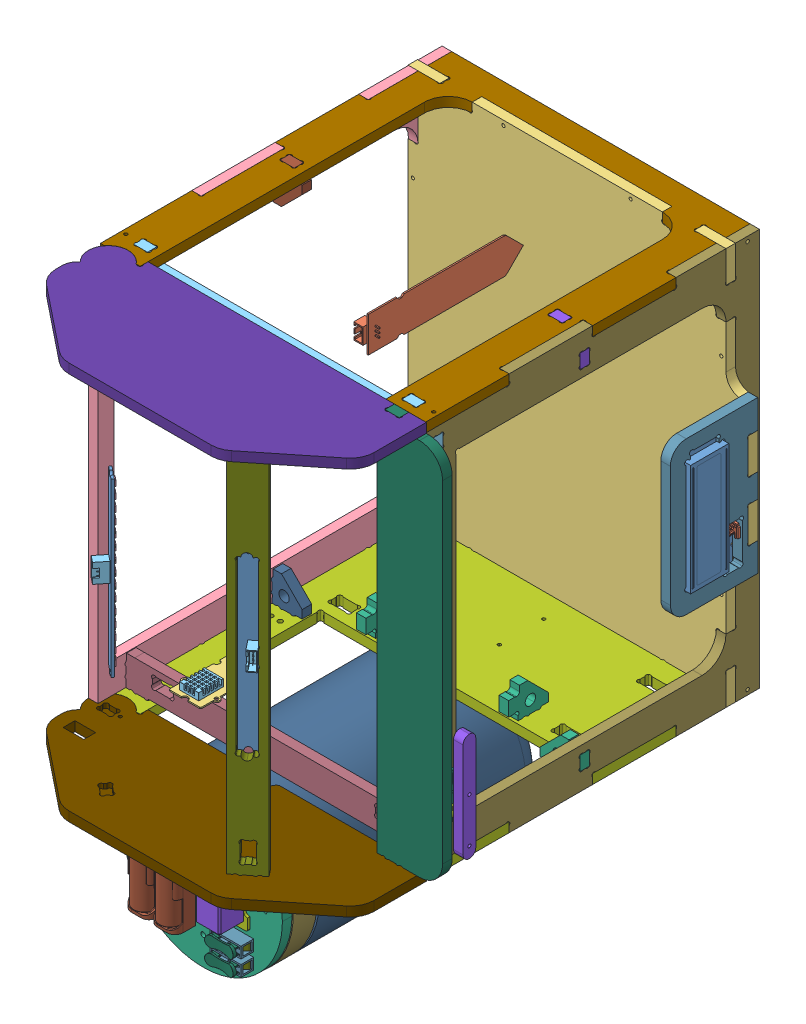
SolidWorks assembly mini-serre.SLDASM, configuration Défaut (file format 14000). Lengths in mm.
Overall size (259.36 419.88 382.09).
168 component instances, 59 part files, 4 mates.
Components (placement in the parent):
- Structure-mini-serre^mini-serre-1: Structure-mini-serre^mini-serre.SLDASM [Défaut] at origin size (221.16 259.01 255.35) (virtual)
  - Grove LCD RGB Backlight-1: Grove LCD RGB Backlight.SLDASM [Défaut] at (-67.9977 131.5318 43.0881) x (0 1 0) z (1 0 0) size (84.5 44.5 10)
    - LCD RGB Backlight-1: LCD RGB Backlight.SLDPRT [Défaut] at (-6.532 1.7619 75) size (84.5 44.5 10)
    - Connecteur BSG-1: Connecteur BSG.SLDPRT [Défaut] at (-24.032 -12.7381 76) x (0 -1 0) z (-1 0 0) size (10 5.5 9)
  - base-1: base.SLDPRT [Défaut] at (-2480.9343 -235.2781 15.1) size (214 250 6)
  - face-arriere-1: face-arriere.SLDPRT [Défaut] at (-199.5174 -2049.2872 208.3653) x (-0.000065 1 0) z (1 0.000065 0.000058) size (250 222.5 6)
  - link-structure-2-1: link-structure-2.SLDPRT [Défaut] at (-206.3391 -1796.186 199) x (0 1 0) z (0 0 1) size (25 200 6)
  - link-corner-h-2-1: link-corner-h-2.SLDPRT [Défaut] at (1754.5666 -1631.6249 107.1518) x (-0.707107 0.707107 -0.000041) z (-0.000058 0 1) size (18.39 28.28 6)
  - face-gauche-1: face-gauche.SLDPRT [Défaut] at (2301.851 5.8678 226.3536) x (-1 0.000057 -0.000058) z (-0.000057 -1 0) size (199.65 215.01 6)
  - link-corner-2-1: link-corner-2.SLDPRT [Défaut] at (1606.5858 1979.9525 107.05) x (-0.707188 -0.707025 0) z (0 0 1) size (18.39 28.28 6)
  - cote-droit-1: cote-droit.SLDPRT [Défaut] at (-2501.9597 250.146 208.3762) x (1 -0.000057 0) z (-0.000057 -1 0) size (199.64 215 6)
  - link-corner-h-1: link-corner-h.SLDPRT [Défaut] at (-1860.061 -1782.953 106.9544) x (0.707188 0.707026 0.000041) z (-0.000058 0 1) size (18.39 28.28 6)
  - link-corner-1: link-corner.SLDPRT [Défaut] at (1531.695 -1357.5526 107.1497) x (-0.707112 0.707101 -0.000041) z (-0.000058 0 1) size (18.39 28.28 6)
  - face-1: face.SLDPRT [Défaut] at (0.1319 2297.4825 -18.1746) x (-0.000057 -1 0) z (-1 0.000057 0) size (250 210 6)
  - Lien-structure-1: Lien-structure.SLDPRT [Défaut] at (-214.8947 2044.2142 199) x (-0.000115 -1 0) z (0 0 1) size (25 200 6)
  - Ecran-lcd-part-1: Ecran-lcd-part.SLDPRT [Défaut] at (8.0023 1597.9491 -1616.1588) x (0 -0.707107 0.707107) z (1 0 0) size (103.45 103.53 6)
  - link-corner-h-2-2: link-corner-h-2.SLDPRT [Défaut] at (-141.9718 -1631.6249 1860.2666) x (0.000041 0.707107 -0.707107) z (-1 0 -0.000058) size (18.39 28.28 6)
  - link-corner-h-2-3: link-corner-h-2.SLDPRT [Défaut] at (-52.2018 -1631.6249 1860.2666) x (0.000041 0.707107 -0.707107) z (-1 0 -0.000058) size (18.39 28.28 6)
- Toit-mini-serre^mini-serre-1: Toit-mini-serre^mini-serre.SLDASM [Défaut] at origin size (235.57 250 235.57) (virtual)
  - Copie de Assemblage2^Toit-mini-serre_mini-serre-1: Copie de Assemblage2^Toit-mini-serre_mini-serre.SLDASM [Défaut] at origin size (235.57 250 235.57) (virtual)
    - LED-part-1: LED-part.SLDPRT [Défaut] at (-1979.0304 67.4087 -1197.3538) x (0.780869 0 0.624695) z (0.624695 0 -0.780869) size (19 244 6)
    - face-toit-1: face-toit.SLDPRT [Défaut] at (-2448.5747 182.5863 210.0095) size (41.32 250 6)
    - link-toit-1-1: link-toit-1.SLDPRT [Défaut] at (-2588.796 182.5863 219.5095) size (16.76 244 6)
    - LED-part-2-1: LED-part-2.SLDPRT [Défaut] at (-1909.6279 67.4087 1754.1825) x (0.780869 0 -0.624695) z (-0.624695 0 -0.780869) size (19 244 6)
    - toit-gauche-1: toit-gauche.SLDPRT [Défaut] at (-1565.0302 249.9974 1827.6786) x (0.707107 0 -0.707107) z (0 -1 0) size (169.16 163.98 6)
    - toit-droit-1: toit-droit.SLDPRT [Défaut] at (-1553.7308 -0.0025 1858.6653) x (0.707107 0 -0.707107) z (0 1 0) size (169.16 163.98 6)
  - Grove RGB LED Stick-1: Grove RGB LED Stick.SLDASM [Défaut] at (-195.2236 126.5668 327.9829) x (0 1 0) z (0.625243 0 -0.78043) size (110 10 10.3)
    - BaseBOARD-1: BaseBOARD.SLDPRT [Défaut] at (-1.5498 2.2311 81.25) size (110 10 1.5)
    - 201-1: 201.SLDPRT [Défaut] at (-46.6853 0.8998 82.75) size (0.8 1.5 0.8)
    - 200-1: 200.SLDPRT [Défaut] at (-46.6853 3.3998 82.75) size (0.8 1.5 0.8)
    - 201-2: 201.SLDPRT [Défaut] at (-39.1853 0.8998 82.75) size (0.8 1.5 0.8)
    - 201-3: 201.SLDPRT [Défaut] at (-31.6853 0.8998 82.75) size (0.8 1.5 0.8)
    - 201-4: 201.SLDPRT [Défaut] at (-24.1853 0.8998 82.75) size (0.8 1.5 0.8)
    - 201-5: 201.SLDPRT [Défaut] at (-16.6853 0.8998 82.75) size (0.8 1.5 0.8)
    - 201-6: 201.SLDPRT [Défaut] at (-9.1853 0.8998 82.75) size (0.8 1.5 0.8)
    - 201-7: 201.SLDPRT [Défaut] at (-1.6853 0.8998 82.75) size (0.8 1.5 0.8)
    - 201-8: 201.SLDPRT [Défaut] at (5.8147 0.8998 82.75) size (0.8 1.5 0.8)
    - 201-9: 201.SLDPRT [Défaut] at (13.3147 0.8998 82.75) size (0.8 1.5 0.8)
    - 201-10: 201.SLDPRT [Défaut] at (20.8147 0.8998 82.75) size (0.8 1.5 0.8)
    - 200-2: 200.SLDPRT [Défaut] at (-39.1853 3.3998 82.75) size (0.8 1.5 0.8)
    - 200-3: 200.SLDPRT [Défaut] at (-31.6853 3.3998 82.75) size (0.8 1.5 0.8)
    - 200-4: 200.SLDPRT [Défaut] at (-24.1853 3.3998 82.75) size (0.8 1.5 0.8)
    - 200-5: 200.SLDPRT [Défaut] at (-16.6853 3.3998 82.75) size (0.8 1.5 0.8)
    - 200-6: 200.SLDPRT [Défaut] at (-9.1853 3.3998 82.75) size (0.8 1.5 0.8)
    - 200-7: 200.SLDPRT [Défaut] at (-1.6853 3.3998 82.75) size (0.8 1.5 0.8)
    - 200-8: 200.SLDPRT [Défaut] at (5.8147 3.3998 82.75) size (0.8 1.5 0.8)
    - 200-9: 200.SLDPRT [Défaut] at (13.3147 3.3998 82.75) size (0.8 1.5 0.8)
    - 200-10: 200.SLDPRT [Défaut] at (20.8147 3.3998 82.75) size (0.8 1.5 0.8)
    - LED RGB-1: LED RGB.SLDPRT [Défaut] at (-50.2998 2.2311 82.75) size (3.5 3.74 1)
    - LED RGB-2: LED RGB.SLDPRT [Défaut] at (-43.2998 2.2311 82.75) size (3.5 3.74 1)
    - LED RGB-3: LED RGB.SLDPRT [Défaut] at (-36.2998 2.2311 82.75) size (3.5 3.74 1)
    - LED RGB-4: LED RGB.SLDPRT [Défaut] at (-29.2998 2.2311 82.75) size (3.5 3.74 1)
    - LED RGB-5: LED RGB.SLDPRT [Défaut] at (-22.2998 2.2311 82.75) size (3.5 3.74 1)
    - LED RGB-6: LED RGB.SLDPRT [Défaut] at (-15.2998 2.2311 82.75) size (3.5 3.74 1)
    - LED RGB-7: LED RGB.SLDPRT [Défaut] at (-8.2998 2.2311 82.75) size (3.5 3.74 1)
    - LED RGB-8: LED RGB.SLDPRT [Défaut] at (-1.2998 2.2311 82.75) size (3.5 3.74 1)
    - LED RGB-9: LED RGB.SLDPRT [Défaut] at (5.7002 2.2311 82.75) size (3.5 3.74 1)
    - LED RGB-10: LED RGB.SLDPRT [Défaut] at (12.7002 2.2311 82.75) size (3.5 3.74 1)
    - Grove Connecteur BSG-1: Grove Connecteur BSG.SLDPRT [Défaut] at (-1.5498 -3.4689 72) x (0 0 1) z (-1 0 0) size (7.8 5.3 12)
    - LED RGB-12: LED RGB.SLDPRT [Défaut] at (19.7002 2.2311 82.75) size (3.5 3.74 1)
    - LED RGB-13: LED RGB.SLDPRT [Défaut] at (26.7002 2.2311 82.75) size (3.5 3.74 1)
    - LED RGB-14: LED RGB.SLDPRT [Défaut] at (33.7002 2.2311 82.75) size (3.5 3.74 1)
    - LED RGB-15: LED RGB.SLDPRT [Défaut] at (40.7002 2.2311 82.75) size (3.5 3.74 1)
    - LED RGB-16: LED RGB.SLDPRT [Défaut] at (47.7002 2.2311 82.75) size (3.5 3.74 1)
  - Grove RGB LED Stick-2: Grove RGB LED Stick.SLDASM [Défaut] at (-3.4069 123.4177 327.472) x (0 -1 0) z (-0.625243 0 -0.78043) size (110 10 10.3)
    - BaseBOARD-1: BaseBOARD.SLDPRT [Défaut] at (-1.5498 2.2311 81.25) size (110 10 1.5)
    - 201-1: 201.SLDPRT [Défaut] at (-46.6853 0.8998 82.75) size (0.8 1.5 0.8)
    - 200-1: 200.SLDPRT [Défaut] at (-46.6853 3.3998 82.75) size (0.8 1.5 0.8)
    - 201-2: 201.SLDPRT [Défaut] at (-39.1853 0.8998 82.75) size (0.8 1.5 0.8)
    - 201-3: 201.SLDPRT [Défaut] at (-31.6853 0.8998 82.75) size (0.8 1.5 0.8)
    - 201-4: 201.SLDPRT [Défaut] at (-24.1853 0.8998 82.75) size (0.8 1.5 0.8)
    - 201-5: 201.SLDPRT [Défaut] at (-16.6853 0.8998 82.75) size (0.8 1.5 0.8)
    - 201-6: 201.SLDPRT [Défaut] at (-9.1853 0.8998 82.75) size (0.8 1.5 0.8)
    - 201-7: 201.SLDPRT [Défaut] at (-1.6853 0.8998 82.75) size (0.8 1.5 0.8)
    - 201-8: 201.SLDPRT [Défaut] at (5.8147 0.8998 82.75) size (0.8 1.5 0.8)
    - 201-9: 201.SLDPRT [Défaut] at (13.3147 0.8998 82.75) size (0.8 1.5 0.8)
    - 201-10: 201.SLDPRT [Défaut] at (20.8147 0.8998 82.75) size (0.8 1.5 0.8)
    - 200-2: 200.SLDPRT [Défaut] at (-39.1853 3.3998 82.75) size (0.8 1.5 0.8)
    - 200-3: 200.SLDPRT [Défaut] at (-31.6853 3.3998 82.75) size (0.8 1.5 0.8)
    - 200-4: 200.SLDPRT [Défaut] at (-24.1853 3.3998 82.75) size (0.8 1.5 0.8)
    - 200-5: 200.SLDPRT [Défaut] at (-16.6853 3.3998 82.75) size (0.8 1.5 0.8)
    - 200-6: 200.SLDPRT [Défaut] at (-9.1853 3.3998 82.75) size (0.8 1.5 0.8)
    - 200-7: 200.SLDPRT [Défaut] at (-1.6853 3.3998 82.75) size (0.8 1.5 0.8)
    - 200-8: 200.SLDPRT [Défaut] at (5.8147 3.3998 82.75) size (0.8 1.5 0.8)
    - 200-9: 200.SLDPRT [Défaut] at (13.3147 3.3998 82.75) size (0.8 1.5 0.8)
    - 200-10: 200.SLDPRT [Défaut] at (20.8147 3.3998 82.75) size (0.8 1.5 0.8)
    - LED RGB-1: LED RGB.SLDPRT [Défaut] at (-50.2998 2.2311 82.75) size (3.5 3.74 1)
    - LED RGB-2: LED RGB.SLDPRT [Défaut] at (-43.2998 2.2311 82.75) size (3.5 3.74 1)
    - LED RGB-3: LED RGB.SLDPRT [Défaut] at (-36.2998 2.2311 82.75) size (3.5 3.74 1)
    - LED RGB-4: LED RGB.SLDPRT [Défaut] at (-29.2998 2.2311 82.75) size (3.5 3.74 1)
    - LED RGB-5: LED RGB.SLDPRT [Défaut] at (-22.2998 2.2311 82.75) size (3.5 3.74 1)
    - LED RGB-6: LED RGB.SLDPRT [Défaut] at (-15.2998 2.2311 82.75) size (3.5 3.74 1)
    - LED RGB-7: LED RGB.SLDPRT [Défaut] at (-8.2998 2.2311 82.75) size (3.5 3.74 1)
    - LED RGB-8: LED RGB.SLDPRT [Défaut] at (-1.2998 2.2311 82.75) size (3.5 3.74 1)
    - LED RGB-9: LED RGB.SLDPRT [Défaut] at (5.7002 2.2311 82.75) size (3.5 3.74 1)
    - LED RGB-10: LED RGB.SLDPRT [Défaut] at (12.7002 2.2311 82.75) size (3.5 3.74 1)
    - Grove Connecteur BSG-1: Grove Connecteur BSG.SLDPRT [Défaut] at (-1.5498 -3.4689 72) x (0 0 1) z (-1 0 0) size (7.8 5.3 12)
    - LED RGB-12: LED RGB.SLDPRT [Défaut] at (19.7002 2.2311 82.75) size (3.5 3.74 1)
    - LED RGB-13: LED RGB.SLDPRT [Défaut] at (26.7002 2.2311 82.75) size (3.5 3.74 1)
    - LED RGB-14: LED RGB.SLDPRT [Défaut] at (33.7002 2.2311 82.75) size (3.5 3.74 1)
    - LED RGB-15: LED RGB.SLDPRT [Défaut] at (40.7002 2.2311 82.75) size (3.5 3.74 1)
    - LED RGB-16: LED RGB.SLDPRT [Défaut] at (47.7002 2.2311 82.75) size (3.5 3.74 1)
  - roof-1: roof.SLDPRT [Défaut] at (20.573 244.0919 -195.0378) x (0.707107 0 0.707107) z (0 -1 0) size (147.72 162.72 238)
- Servomoteur et bras^mini-serre-1: Servomoteur et bras^mini-serre.SLDASM [Défaut] at origin size (37.3 67.88 12.5) (virtual)
  - microservoAssembly-1: microservoAssembly.SLDASM [Default] at (-19.2414 39.0658 229.9783) x (0.000057 1 0) z (0 0 -1) size (38.45 31.3 12.5)
    - microservoSG90-1: microservoSG90.SLDPRT [Default] at (7.8094 3.3655 26.0766) size (32.3 29.8 12.5)
    - microservoArm-1: microservoArm.SLDPRT [A2] at (2.7094 34.6655 26.0766) x (-1 0 0.000751) z (0.000751 0 1) size (34.4 3.9 7)
  - bras-servo-1: bras-servo.SLDPRT [Défaut] at (21.2885 -2320.9995 317.1838) x (0.000057 1 0) z (-1 0.000057 0) size (67.88 8 6)
- Seeeduino Lotus-1: Seeeduino Lotus.SLDASM [Défaut] at (-141.0646 8.3903 37.923) x (0 0 -1) z (-1 0 0) size (53.34 19.37 69.58)
  - Lotus seeedstudio-1: Lotus seeedstudio.SLDASM [Défaut] at (-13.7768 12.6871 -16.7611) x (0 0 -1) z (0 1 0) size (69.58 53.34 11.76)
    - PCB Lotus-1: PCB Lotus.SLDPRT [Défaut] at (-41.2611 -23.1126 -0.8) size (68.58 53.34 1.6)
    - Connecteur Grove (droit)-1: Connecteur Grove (droit).SLDPRT [Défaut] at (-17.3889 -10.5311 0.8) x (0 1 0) z (1 0 0) size (10 11 5)
    - Connecteur Grove (droit)-2: Connecteur Grove (droit).SLDPRT [Défaut] at (-5.3889 -10.5311 0.8) x (0 1 0) z (1 0 0) size (10 11 5)
    - Connecteur Grove (droit)-3: Connecteur Grove (droit).SLDPRT [Défaut] at (6.6111 -10.5311 0.8) x (0 1 0) z (1 0 0) size (10 11 5)
    - Connecteur Grove (droit)-4: Connecteur Grove (droit).SLDPRT [Défaut] at (18.6111 -10.5311 0.8) x (0 1 0) z (1 0 0) size (10 11 5)
    - Connecteur Grove (droit)-5: Connecteur Grove (droit).SLDPRT [Défaut] at (-17.3889 3.4689 0.8) x (0 1 0) z (1 0 0) size (10 11 5)
    - Connecteur Grove (droit)-6: Connecteur Grove (droit).SLDPRT [Défaut] at (-5.3889 3.4689 0.8) x (0 1 0) z (1 0 0) size (10 11 5)
    - Connecteur Grove (droit)-7: Connecteur Grove (droit).SLDPRT [Défaut] at (6.6111 3.4689 0.8) x (0 1 0) z (1 0 0) size (10 11 5)
    - Connecteur Grove (droit)-8: Connecteur Grove (droit).SLDPRT [Défaut] at (18.6111 3.4689 0.8) x (0 1 0) z (1 0 0) size (10 11 5)
    - Connecteur Grove (droit)-9: Connecteur Grove (droit).SLDPRT [Défaut] at (-17.3889 17.4689 0.8) x (0 1 0) z (1 0 0) size (10 11 5)
    - Connecteur Grove (droit)-10: Connecteur Grove (droit).SLDPRT [Défaut] at (-5.3889 17.4689 0.8) x (0 1 0) z (1 0 0) size (10 11 5)
    - Connecteur Grove (droit)-11: Connecteur Grove (droit).SLDPRT [Défaut] at (6.6111 17.4689 0.8) x (0 1 0) z (1 0 0) size (10 11 5)
    - Connecteur Grove (droit)-12: Connecteur Grove (droit).SLDPRT [Défaut] at (18.6111 17.4689 0.8) x (0 1 0) z (1 0 0) size (10 11 5)
    - 2pin_header__02 Y-1: 2pin_header__02 Y.sldprt [Default] at (23.5406 7.504 0.8) x (1 0 0) z (0 -1 0) size (5 11.75 2.54)
    - 6 PORT HEADER Y-1: 6 PORT HEADER Y.SLDPRT [Default] at (9.5283 -20.6231 0.8) x (1 0 0) z (0 -1 0) size (15.24 10.51 2.41)
    - 8 PORT HEADER Y-1: 8 PORT HEADER Y.SLDPRT [Default] at (-13.2368 -20.594 0.8) x (1 0 0) z (0 -1 0) size (20.32 10.51 2.41)
    - 8 PORT HEADER Y-2: 8 PORT HEADER Y.SLDPRT [Default] at (4.3577 27.6832 0.8) x (1 0 0) z (0 -1 0) size (20.32 10.51 2.41)
    - 10 PORT HEADER Y-1: 10 PORT HEADER Y.SLDPRT [Default] at (-22.4666 27.7113 0.8) x (1 0 0) z (0 -1 0) size (25.4 10.51 2.41)
    - 2pin_header__02 Y-2: 2pin_header__02 Y.sldprt [Default] at (23.5406 4.964 0.8) x (1 0 0) z (0 -1 0) size (5 11.75 2.54)
    - 2pin_header__02 Y-3: 2pin_header__02 Y.sldprt [Default] at (23.5406 2.424 0.8) x (1 0 0) z (0 -1 0) size (5 11.75 2.54)
    - Bouton_RST - CMS-1: Bouton_RST - CMS.SLDPRT [Défaut] at (-21.577 -20.8281 0.8) x (1 0 0) z (0 -1 0) size (7 3.4 3.4)
    - atmega16u2-1: atmega16u2.SLDPRT [Default] at (-29.8717 -8.9881 0.85) x (1 0 0) z (0 1 0) size (5.5 1.01 5.5)
    - micro_usb_47346-0001-1: micro_usb_47346-0001.SLDPRT [Default] at (-39.4811 7.4215 2.025) x (0 -1 0) z (-1 0 0) size (7.98 2.94 5.43)
  - ent-3x4-1: ent-3x4.SLDPRT [Défaut] at (1.7416 11.6776 -40.1862) x (0 -1 0) z (-1 0 0) size (3 4 4) (hidden)
  - ent-3x4-2: ent-3x4.SLDPRT [Défaut] at (-41.442 11.6776 10.5682) x (0 -1 0) z (-1 0 0) size (3 4 4) (hidden)
  - ent-3x4-3: ent-3x4.SLDPRT [Défaut] at (-26.2041 11.6776 -40.1958) x (0 -1 0) z (-1 0 0) size (3 4 4) (hidden)
  - V-m2x12-1: V-m2x12.SLDPRT [Défaut] at (-26.0836 13.6288 -41.2937) x (0 -1 0) z (-1 0 0) size (11 4 4) (hidden)
  - V-m2x12-2: V-m2x12.SLDPRT [Défaut] at (1.8577 13.6288 -41.2318) x (0 -1 0) z (-1 0 0) size (11 4 4) (hidden)
  - V-m2x12-3: V-m2x12.SLDPRT [Défaut] at (-41.4608 13.6288 9.2647) x (0 -1 0) z (-1 0 0) size (11 4 4) (hidden)
- Capacative Soil Moisture Sensor v1.2-1: Capacative Soil Moisture Sensor v1.2.SLDPRT [Default] at (-118.5638 196.9819 127.4725) x (0 -1 0) z (-1 0 0) size (22.23 100 9.2)
- Capteur DHT11^mini-serre-1: Capteur DHT11^mini-serre.SLDASM [Défaut] at origin size (24 11 42) (virtual)
  - SHT35 board-1: SHT35 board.SLDASM [Default] at (-158.5024 11.9752 165.2422) x (1 -0.000115 0) z (0 0 1) size (24 0.8 42)
    - SHT31 sensor board-2: SHT31 sensor board.SLDPRT [Default] at (-0.8008 13.0423 46.9639) size (24 0.8 42)
  - Grove socket-1: Grove socket.SLDPRT [Default] at (-144.4085 25.8159 175.1835) x (-1 0.000115 0) z (0 0 -1) size (10 11 5)
  - DHT11-1: DHT11.SLDPRT [Default] at (-143.5754 24.8158 193.704) x (-1 0.000115 0) z (0.000115 1 0) size (14 35.05 6.5)
- Vitres^mini-serre-1: Vitres^mini-serre.SLDASM [Défaut] at origin size (187.63 238.13 204.91) (virtual)
  - Parois1-1: Parois1.SLDPRT [Défaut] at (-6.0338 1051.6214 -448.3288) x (0 -1 0) z (-1 0 0) size (209 190 0.5)
  - parois2-1: parois2.SLDPRT [Défaut] at (-1311.1142 243.4373 674.5586) x (1 0 0) z (0 1 0) size (158 190 0.5)
  - parois3-1: parois3.SLDPRT [Défaut] at (-193.6628 1042.7437 432.6914) x (0 -1 0) z (1 0 0) size (209 202 0.5)
  - parois4-1: parois4.SLDPRT [Défaut] at (-1322.4512 6.3123 -152.09) x (1 0 0) z (0 -1 0) size (158 115 0.5)
- Arrosage ^mini-serre-1: Arrosage ^mini-serre.SLDASM [Défaut] at origin size (100.04 100.22 182.22) (virtual)
  - Copie de Assemblage3^Arrosage _mini-serre-1: Copie de Assemblage3^Arrosage _mini-serre.SLDASM [Défaut] at origin size (100.04 100.22 182.22) (virtual)
    - arrosage-part-1: arrosage-part.SLDPRT [Défaut] at (1352.715 -394.4112 161.8929) x (-1 0 0) z (0 0 -1) size (99.5 99.5 6)
    - Grove relay v1.2-1: Grove relay v1.2.SLDASM [Défaut] at (-166.0206 -103.0981 168.3297) x (0 -1 0) z (-1 0 0) size (41.8 18.5 23.6)
      - PCB grove 20x40-1: PCB grove 20x40.SLDPRT [Défaut] at (4.6282 -3.7785 0) size (41.8 1.6 23.6)
      - Relais HLS8L-DC3V-S-C-1: Relais HLS8L-DC3V-S-C.SLDPRT [Défaut] at (11.6282 -2.1785 0.25) x (-1 0 0) z (0 0 -1) size (19.55 18.5 15.5)
      - Connecteur Grove (droit)-1: Connecteur Grove (droit).SLDPRT [Défaut] at (-9.3718 -2.1785 0) x (0 0 -1) z (1 0 0) size (10 11 5)
      - Bornier 2ct-1: Bornier 2ct.SLDPRT [Défaut] at (-6.6218 -2.1785 4.3) size (7.8 11.38 7)
    - res-1l-1: res-1l.SLDPRT [Défaut] at (-182.045 -117.4513 -1.0732) x (-1 0 0) z (0 1 0) size (100 150 100)
    - Battery Holder-1: Battery Holder.SLDPRT [Default] at (-200.7684 -116.4127 162.0808) x (-1 0 0) z (0 1 0) size (32.51 14.54 61.78)
    - cap-res-1l-1: cap-res-1l.SLDPRT [Défaut] at (-187.8981 -115.1513 140.4718) x (1 0 0) z (0 -1 0) size (100 15 100)
  - KDP-370EB12v-1: KDP-370EB12v.SLDPRT [Default] at (-196.9316 -125.1491 96.9986) x (0 0 1) z (-1 0 0) size (77.53 27.15 27.2)
  - CH2, 2P Quick Connector Spring Clamp Terminal Block-1: CH2, 2P Quick Connector Spring Clamp Terminal Block.SLDASM [Default] at (-165.9157 -142.2055 165.9762) x (-1 0 0) z (0 1 0) size (19.4 12.48 18.83)
    - Main Body, CH2, 2P Quick Connector Spring Clamp Terminal Block-1: Main Body, CH2, 2P Quick Connector Spring Clamp Terminal Block.SLDPRT [Default] at origin size (19.4 10 17)
    - Clamping Button, CH2, 2P Quick Connector Spring Clamp Terminal Block-1: Clamping Button, CH2, 2P Quick Connector Spring Clamp Terminal Block.SLDPRT [Default] at (0 6.1 5) size (18.22 9.38 8.83)
    - Clamping Button, CH2, 2P Quick Connector Spring Clamp Terminal Block-2: Clamping Button, CH2, 2P Quick Connector Spring Clamp Terminal Block.SLDPRT [Default] at (0 6.1 -5) size (18.22 9.38 8.83)
    - Metal Clamp, CH2, 2P Quick Connector Spring Clamp Terminal Block-1: Metal Clamp, CH2, 2P Quick Connector Spring Clamp Terminal Block.SLDPRT [Default] at (0 -2.8 5) size (18.2 5 5)
    - Metal Clamp, CH2, 2P Quick Connector Spring Clamp Terminal Block-2: Metal Clamp, CH2, 2P Quick Connector Spring Clamp Terminal Block.SLDPRT [Default] at (0 -2.8 -5) size (18.2 5 5)
Mates (geometry in assembly coordinates):
- Coïncidente67: coincident: point of Structure-mini-serre^mini-serre-1/face-1
- Coïncidente70: coincident anti-aligned: plane of Assemblage6^mini-serre-1/Lien-structure-1 through (-215.1266 25.024 205) normal (0.000115 1 0); plane of Assemblage1^mini-serre-1/SHT35 board-1/SHT31 sensor board-2 through (-158.5017 25.0175 211.406) normal (-0.000115 -1 0)
- Coïncidente71: coincident anti-aligned: plane of Structure-mini-serre^mini-serre-1/face-1 through (-5.998 35.5744 -18.1746) normal (0.000057 1 0); plane of Assemblage7^mini-serre-1/microservoAssembly-1/microservoSG90-1 through (-0.2762 35.5741 197.7016) normal (-0.000057 -1 0)
- Coïncidente72: coincident anti-aligned: plane of Structure-mini-serre^mini-serre-1/face-1 through (-5.8681 2297.4829 197.7016) normal (0 0 1); plane of Assemblage7^mini-serre-1/microservoAssembly-1/microservoSG90-1 through (-0.2762 35.5741 197.7016) normal (0 0 -1)
